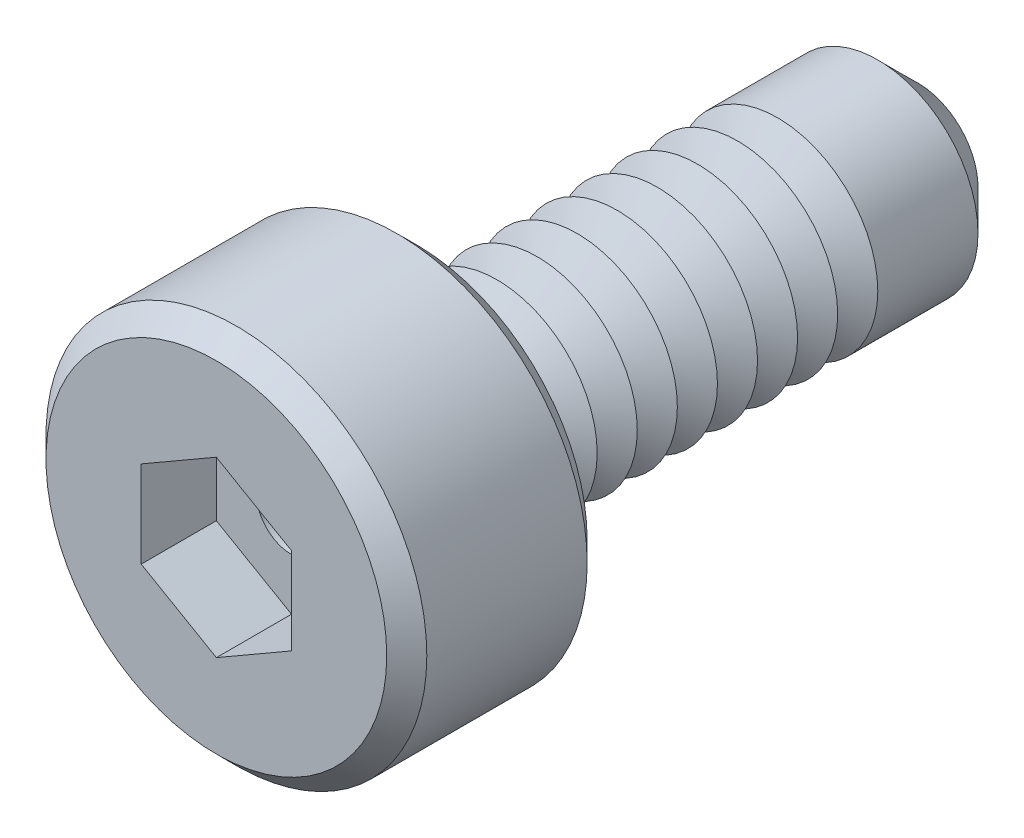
ISO-10303-21;
HEADER;
FILE_DESCRIPTION(('STEP AP214'),'2;1');
FILE_NAME('part.step','',(''),(''),'','','');
FILE_SCHEMA(('AUTOMOTIVE_DESIGN { 1 0 10303 214 1 1 1 1 }'));
ENDSEC;
DATA;
#1=APPLICATION_CONTEXT('core data for automotive mechanical design processes');
#2=APPLICATION_PROTOCOL_DEFINITION('international standard','automotive_design',2000,#1);
#3=PRODUCT_CONTEXT('',#1,'mechanical');
#4=PRODUCT('Part','Part','',(#3));
#5=PRODUCT_RELATED_PRODUCT_CATEGORY('part','',(#4));
#6=PRODUCT_DEFINITION_FORMATION('','',#4);
#7=PRODUCT_DEFINITION_CONTEXT('part definition',#1,'design');
#8=PRODUCT_DEFINITION('design','',#6,#7);
#9=PRODUCT_DEFINITION_SHAPE('','',#8);
#10=(LENGTH_UNIT() NAMED_UNIT(*) SI_UNIT(.MILLI.,.METRE.));
#11=(NAMED_UNIT(*) PLANE_ANGLE_UNIT() SI_UNIT($,.RADIAN.));
#12=(NAMED_UNIT(*) SI_UNIT($,.STERADIAN.) SOLID_ANGLE_UNIT());
#13=UNCERTAINTY_MEASURE_WITH_UNIT(LENGTH_MEASURE(1.E-05),#10,'distance_accuracy_value','');
#14=(GEOMETRIC_REPRESENTATION_CONTEXT(3) GLOBAL_UNCERTAINTY_ASSIGNED_CONTEXT((#13)) GLOBAL_UNIT_ASSIGNED_CONTEXT((#10,
#11,#12)) REPRESENTATION_CONTEXT('',''));
#15=CARTESIAN_POINT('',(0.,0.,0.));
#16=DIRECTION('',(0.,0.,1.));
#17=DIRECTION('',(1.,0.,0.));
#18=AXIS2_PLACEMENT_3D('',#15,#16,#17);
#19=CARTESIAN_POINT('',(0.,0.,2.));
#20=DIRECTION('',(0.,0.,-1.));
#21=DIRECTION('',(-1.,0.,0.));
#22=AXIS2_PLACEMENT_3D('',#19,#20,#21);
#23=CYLINDRICAL_SURFACE('',#22,1.9);
#24=CARTESIAN_POINT('',(0.,0.,0.200000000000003));
#25=DIRECTION('',(0.,0.,1.));
#26=DIRECTION('',(1.,0.,0.));
#27=AXIS2_PLACEMENT_3D('',#24,#25,#26);
#28=CIRCLE('',#27,1.9);
#29=CARTESIAN_POINT('',(1.9,0.,0.200000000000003));
#30=VERTEX_POINT('',#29);
#31=EDGE_CURVE('E252',#30,#30,#28,.T.);
#32=ORIENTED_EDGE('',*,*,#31,.T.);
#33=EDGE_LOOP('',(#32));
#34=FACE_BOUND('',#33,.T.);
#35=CARTESIAN_POINT('',(0.,0.,1.8));
#36=DIRECTION('',(0.,0.,1.));
#37=DIRECTION('',(1.,0.,0.));
#38=AXIS2_PLACEMENT_3D('',#35,#36,#37);
#39=CIRCLE('',#38,1.9);
#40=CARTESIAN_POINT('',(1.9,0.,1.8));
#41=VERTEX_POINT('',#40);
#42=EDGE_CURVE('E248',#41,#41,#39,.F.);
#43=ORIENTED_EDGE('',*,*,#42,.T.);
#44=EDGE_LOOP('',(#43));
#45=FACE_BOUND('',#44,.T.);
#46=ADVANCED_FACE('F39',(#34,#45),#23,.T.);
#47=CARTESIAN_POINT('',(0.,0.,2.));
#48=DIRECTION('',(0.,0.,1.));
#49=DIRECTION('',(1.,0.,0.));
#50=AXIS2_PLACEMENT_3D('',#47,#48,#49);
#51=PLANE('',#50);
#52=CARTESIAN_POINT('',(0.,0.,2.));
#53=DIRECTION('',(0.,0.,1.));
#54=DIRECTION('',(1.,0.,0.));
#55=AXIS2_PLACEMENT_3D('',#52,#53,#54);
#56=CIRCLE('',#55,1.7);
#57=CARTESIAN_POINT('',(1.7,0.,2.));
#58=VERTEX_POINT('',#57);
#59=EDGE_CURVE('E11',#58,#58,#56,.T.);
#60=ORIENTED_EDGE('',*,*,#59,.T.);
#61=EDGE_LOOP('',(#60));
#62=FACE_BOUND('',#61,.T.);
#63=DIRECTION('',(-0.866025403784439,0.5,0.));
#64=VECTOR('',#63,1.);
#65=CARTESIAN_POINT('',(0.749999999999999,0.433012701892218,2.));
#66=LINE('',#65,#64);
#67=CARTESIAN_POINT('',(0.749999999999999,0.433012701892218,2.));
#68=VERTEX_POINT('',#67);
#69=CARTESIAN_POINT('',(0.,0.866025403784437,2.));
#70=VERTEX_POINT('',#69);
#71=EDGE_CURVE('E55',#68,#70,#66,.T.);
#72=ORIENTED_EDGE('',*,*,#71,.F.);
#73=DIRECTION('',(0.,1.,0.));
#74=VECTOR('',#73,1.);
#75=CARTESIAN_POINT('',(0.75,-0.433012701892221,2.));
#76=LINE('',#75,#74);
#77=CARTESIAN_POINT('',(0.75,-0.433012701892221,2.));
#78=VERTEX_POINT('',#77);
#79=EDGE_CURVE('E151',#78,#68,#76,.T.);
#80=ORIENTED_EDGE('',*,*,#79,.F.);
#81=DIRECTION('',(0.866025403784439,0.5,0.));
#82=VECTOR('',#81,1.);
#83=CARTESIAN_POINT('',(0.,-0.86602540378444,2.));
#84=LINE('',#83,#82);
#85=CARTESIAN_POINT('',(0.,-0.86602540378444,2.));
#86=VERTEX_POINT('',#85);
#87=EDGE_CURVE('E148',#86,#78,#84,.T.);
#88=ORIENTED_EDGE('',*,*,#87,.F.);
#89=DIRECTION('',(0.866025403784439,-0.5,0.));
#90=VECTOR('',#89,1.);
#91=CARTESIAN_POINT('',(-0.75,-0.433012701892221,2.));
#92=LINE('',#91,#90);
#93=CARTESIAN_POINT('',(-0.75,-0.433012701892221,2.));
#94=VERTEX_POINT('',#93);
#95=EDGE_CURVE('E103',#94,#86,#92,.T.);
#96=ORIENTED_EDGE('',*,*,#95,.F.);
#97=DIRECTION('',(0.,-1.,0.));
#98=VECTOR('',#97,1.);
#99=CARTESIAN_POINT('',(-0.75,0.433012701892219,2.));
#100=LINE('',#99,#98);
#101=CARTESIAN_POINT('',(-0.75,0.433012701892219,2.));
#102=VERTEX_POINT('',#101);
#103=EDGE_CURVE('E142',#102,#94,#100,.T.);
#104=ORIENTED_EDGE('',*,*,#103,.F.);
#105=DIRECTION('',(-0.866025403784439,-0.499999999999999,0.));
#106=VECTOR('',#105,1.);
#107=CARTESIAN_POINT('',(0.,0.866025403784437,2.));
#108=LINE('',#107,#106);
#109=EDGE_CURVE('E137',#70,#102,#108,.T.);
#110=ORIENTED_EDGE('',*,*,#109,.F.);
#111=EDGE_LOOP('',(#72,#80,#88,#96,#104,#110));
#112=FACE_BOUND('',#111,.T.);
#113=ADVANCED_FACE('F270',(#62,#112),#51,.T.);
#114=CARTESIAN_POINT('',(0.,0.,0.));
#115=DIRECTION('',(0.,0.,1.));
#116=DIRECTION('',(1.,0.,0.));
#117=AXIS2_PLACEMENT_3D('',#114,#115,#116);
#118=PLANE('',#117);
#119=CARTESIAN_POINT('',(0.,0.,0.));
#120=DIRECTION('',(0.,0.,1.));
#121=DIRECTION('',(1.,0.,0.));
#122=AXIS2_PLACEMENT_3D('',#119,#120,#121);
#123=CIRCLE('',#122,1.7);
#124=CARTESIAN_POINT('',(1.7,0.,0.));
#125=VERTEX_POINT('',#124);
#126=EDGE_CURVE('E48',#125,#125,#123,.F.);
#127=ORIENTED_EDGE('',*,*,#126,.T.);
#128=EDGE_LOOP('',(#127));
#129=FACE_BOUND('',#128,.T.);
#130=CARTESIAN_POINT('',(0.,0.,0.));
#131=DIRECTION('',(0.,0.,1.));
#132=DIRECTION('',(1.,0.,0.));
#133=AXIS2_PLACEMENT_3D('',#130,#131,#132);
#134=CIRCLE('',#133,1.);
#135=CARTESIAN_POINT('',(1.,0.,0.));
#136=VERTEX_POINT('',#135);
#137=EDGE_CURVE('E236',#136,#136,#134,.T.);
#138=ORIENTED_EDGE('',*,*,#137,.T.);
#139=EDGE_LOOP('',(#138));
#140=FACE_BOUND('',#139,.T.);
#141=ADVANCED_FACE('F259',(#129,#140),#118,.F.);
#142=CARTESIAN_POINT('',(0.,0.,0.));
#143=DIRECTION('',(0.,0.,1.));
#144=DIRECTION('',(1.,0.,0.));
#145=AXIS2_PLACEMENT_3D('',#142,#143,#144);
#146=CONICAL_SURFACE('',#145,1.,1.0471975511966);
#147=CARTESIAN_POINT('',(0.,0.,-0.200000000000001));
#148=DIRECTION('',(0.,0.,1.));
#149=DIRECTION('',(1.,0.,0.));
#150=AXIS2_PLACEMENT_3D('',#147,#148,#149);
#151=CIRCLE('',#150,0.653589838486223);
#152=CARTESIAN_POINT('',(0.653589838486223,0.,-0.200000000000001));
#153=VERTEX_POINT('',#152);
#154=EDGE_CURVE('E232',#153,#153,#151,.T.);
#155=ORIENTED_EDGE('',*,*,#154,.T.);
#156=EDGE_LOOP('',(#155));
#157=FACE_BOUND('',#156,.T.);
#158=ORIENTED_EDGE('',*,*,#137,.F.);
#159=EDGE_LOOP('',(#158));
#160=FACE_BOUND('',#159,.T.);
#161=ADVANCED_FACE('F392',(#157,#160),#146,.T.);
#162=CARTESIAN_POINT('',(0.,0.,-0.200000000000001));
#163=DIRECTION('',(0.,0.,-1.));
#164=DIRECTION('',(-1.,0.,0.));
#165=AXIS2_PLACEMENT_3D('',#162,#163,#164);
#166=CONICAL_SURFACE('',#165,0.653589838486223,1.0471975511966);
#167=CARTESIAN_POINT('',(0.,0.,-0.4));
#168=DIRECTION('',(0.,0.,1.));
#169=DIRECTION('',(1.,0.,0.));
#170=AXIS2_PLACEMENT_3D('',#167,#168,#169);
#171=CIRCLE('',#170,1.);
#172=CARTESIAN_POINT('',(1.,0.,-0.4));
#173=VERTEX_POINT('',#172);
#174=EDGE_CURVE('E228',#173,#173,#171,.T.);
#175=ORIENTED_EDGE('',*,*,#174,.T.);
#176=EDGE_LOOP('',(#175));
#177=FACE_BOUND('',#176,.T.);
#178=ORIENTED_EDGE('',*,*,#154,.F.);
#179=EDGE_LOOP('',(#178));
#180=FACE_BOUND('',#179,.T.);
#181=ADVANCED_FACE('F388',(#177,#180),#166,.T.);
#182=CARTESIAN_POINT('',(0.,0.,-0.4));
#183=DIRECTION('',(0.,0.,1.));
#184=DIRECTION('',(1.,0.,0.));
#185=AXIS2_PLACEMENT_3D('',#182,#183,#184);
#186=CONICAL_SURFACE('',#185,1.,1.0471975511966);
#187=CARTESIAN_POINT('',(0.,0.,-0.600000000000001));
#188=DIRECTION('',(0.,0.,1.));
#189=DIRECTION('',(1.,0.,0.));
#190=AXIS2_PLACEMENT_3D('',#187,#188,#189);
#191=CIRCLE('',#190,0.653589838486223);
#192=CARTESIAN_POINT('',(0.653589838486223,0.,-0.600000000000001));
#193=VERTEX_POINT('',#192);
#194=EDGE_CURVE('E224',#193,#193,#191,.T.);
#195=ORIENTED_EDGE('',*,*,#194,.T.);
#196=EDGE_LOOP('',(#195));
#197=FACE_BOUND('',#196,.T.);
#198=ORIENTED_EDGE('',*,*,#174,.F.);
#199=EDGE_LOOP('',(#198));
#200=FACE_BOUND('',#199,.T.);
#201=ADVANCED_FACE('F384',(#197,#200),#186,.T.);
#202=CARTESIAN_POINT('',(0.,0.,-0.600000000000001));
#203=DIRECTION('',(0.,0.,-1.));
#204=DIRECTION('',(-1.,0.,0.));
#205=AXIS2_PLACEMENT_3D('',#202,#203,#204);
#206=CONICAL_SURFACE('',#205,0.653589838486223,1.0471975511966);
#207=CARTESIAN_POINT('',(0.,0.,-0.8));
#208=DIRECTION('',(0.,0.,1.));
#209=DIRECTION('',(1.,0.,0.));
#210=AXIS2_PLACEMENT_3D('',#207,#208,#209);
#211=CIRCLE('',#210,1.);
#212=CARTESIAN_POINT('',(1.,0.,-0.8));
#213=VERTEX_POINT('',#212);
#214=EDGE_CURVE('E220',#213,#213,#211,.T.);
#215=ORIENTED_EDGE('',*,*,#214,.T.);
#216=EDGE_LOOP('',(#215));
#217=FACE_BOUND('',#216,.T.);
#218=ORIENTED_EDGE('',*,*,#194,.F.);
#219=EDGE_LOOP('',(#218));
#220=FACE_BOUND('',#219,.T.);
#221=ADVANCED_FACE('F380',(#217,#220),#206,.T.);
#222=CARTESIAN_POINT('',(0.,0.,-0.8));
#223=DIRECTION('',(0.,0.,1.));
#224=DIRECTION('',(1.,0.,0.));
#225=AXIS2_PLACEMENT_3D('',#222,#223,#224);
#226=CONICAL_SURFACE('',#225,1.,1.0471975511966);
#227=CARTESIAN_POINT('',(0.,0.,-1.));
#228=DIRECTION('',(0.,0.,1.));
#229=DIRECTION('',(1.,0.,0.));
#230=AXIS2_PLACEMENT_3D('',#227,#228,#229);
#231=CIRCLE('',#230,0.653589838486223);
#232=CARTESIAN_POINT('',(0.653589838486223,0.,-1.));
#233=VERTEX_POINT('',#232);
#234=EDGE_CURVE('E216',#233,#233,#231,.T.);
#235=ORIENTED_EDGE('',*,*,#234,.T.);
#236=EDGE_LOOP('',(#235));
#237=FACE_BOUND('',#236,.T.);
#238=ORIENTED_EDGE('',*,*,#214,.F.);
#239=EDGE_LOOP('',(#238));
#240=FACE_BOUND('',#239,.T.);
#241=ADVANCED_FACE('F376',(#237,#240),#226,.T.);
#242=CARTESIAN_POINT('',(0.,0.,-1.));
#243=DIRECTION('',(0.,0.,-1.));
#244=DIRECTION('',(-1.,0.,0.));
#245=AXIS2_PLACEMENT_3D('',#242,#243,#244);
#246=CONICAL_SURFACE('',#245,0.653589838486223,1.0471975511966);
#247=CARTESIAN_POINT('',(0.,0.,-1.2));
#248=DIRECTION('',(0.,0.,1.));
#249=DIRECTION('',(1.,0.,0.));
#250=AXIS2_PLACEMENT_3D('',#247,#248,#249);
#251=CIRCLE('',#250,1.);
#252=CARTESIAN_POINT('',(1.,0.,-1.2));
#253=VERTEX_POINT('',#252);
#254=EDGE_CURVE('E212',#253,#253,#251,.T.);
#255=ORIENTED_EDGE('',*,*,#254,.T.);
#256=EDGE_LOOP('',(#255));
#257=FACE_BOUND('',#256,.T.);
#258=ORIENTED_EDGE('',*,*,#234,.F.);
#259=EDGE_LOOP('',(#258));
#260=FACE_BOUND('',#259,.T.);
#261=ADVANCED_FACE('F372',(#257,#260),#246,.T.);
#262=CARTESIAN_POINT('',(0.,0.,-1.2));
#263=DIRECTION('',(0.,0.,1.));
#264=DIRECTION('',(1.,0.,0.));
#265=AXIS2_PLACEMENT_3D('',#262,#263,#264);
#266=CONICAL_SURFACE('',#265,1.,1.0471975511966);
#267=CARTESIAN_POINT('',(0.,0.,-1.4));
#268=DIRECTION('',(0.,0.,1.));
#269=DIRECTION('',(1.,0.,0.));
#270=AXIS2_PLACEMENT_3D('',#267,#268,#269);
#271=CIRCLE('',#270,0.653589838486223);
#272=CARTESIAN_POINT('',(0.653589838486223,0.,-1.4));
#273=VERTEX_POINT('',#272);
#274=EDGE_CURVE('E208',#273,#273,#271,.T.);
#275=ORIENTED_EDGE('',*,*,#274,.T.);
#276=EDGE_LOOP('',(#275));
#277=FACE_BOUND('',#276,.T.);
#278=ORIENTED_EDGE('',*,*,#254,.F.);
#279=EDGE_LOOP('',(#278));
#280=FACE_BOUND('',#279,.T.);
#281=ADVANCED_FACE('F368',(#277,#280),#266,.T.);
#282=CARTESIAN_POINT('',(0.,0.,-1.4));
#283=DIRECTION('',(0.,0.,-1.));
#284=DIRECTION('',(-1.,0.,0.));
#285=AXIS2_PLACEMENT_3D('',#282,#283,#284);
#286=CONICAL_SURFACE('',#285,0.653589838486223,1.0471975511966);
#287=CARTESIAN_POINT('',(0.,0.,-1.6));
#288=DIRECTION('',(0.,0.,1.));
#289=DIRECTION('',(1.,0.,0.));
#290=AXIS2_PLACEMENT_3D('',#287,#288,#289);
#291=CIRCLE('',#290,1.);
#292=CARTESIAN_POINT('',(1.,0.,-1.6));
#293=VERTEX_POINT('',#292);
#294=EDGE_CURVE('E204',#293,#293,#291,.T.);
#295=ORIENTED_EDGE('',*,*,#294,.T.);
#296=EDGE_LOOP('',(#295));
#297=FACE_BOUND('',#296,.T.);
#298=ORIENTED_EDGE('',*,*,#274,.F.);
#299=EDGE_LOOP('',(#298));
#300=FACE_BOUND('',#299,.T.);
#301=ADVANCED_FACE('F364',(#297,#300),#286,.T.);
#302=CARTESIAN_POINT('',(0.,0.,-1.6));
#303=DIRECTION('',(0.,0.,1.));
#304=DIRECTION('',(1.,0.,0.));
#305=AXIS2_PLACEMENT_3D('',#302,#303,#304);
#306=CONICAL_SURFACE('',#305,1.,1.0471975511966);
#307=CARTESIAN_POINT('',(0.,0.,-1.8));
#308=DIRECTION('',(0.,0.,1.));
#309=DIRECTION('',(1.,0.,0.));
#310=AXIS2_PLACEMENT_3D('',#307,#308,#309);
#311=CIRCLE('',#310,0.653589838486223);
#312=CARTESIAN_POINT('',(0.653589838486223,0.,-1.8));
#313=VERTEX_POINT('',#312);
#314=EDGE_CURVE('E201',#313,#313,#311,.T.);
#315=ORIENTED_EDGE('',*,*,#314,.T.);
#316=EDGE_LOOP('',(#315));
#317=FACE_BOUND('',#316,.T.);
#318=ORIENTED_EDGE('',*,*,#294,.F.);
#319=EDGE_LOOP('',(#318));
#320=FACE_BOUND('',#319,.T.);
#321=ADVANCED_FACE('F360',(#317,#320),#306,.T.);
#322=CARTESIAN_POINT('',(0.,0.,-1.8));
#323=DIRECTION('',(0.,0.,-1.));
#324=DIRECTION('',(-1.,0.,0.));
#325=AXIS2_PLACEMENT_3D('',#322,#323,#324);
#326=CONICAL_SURFACE('',#325,0.653589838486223,1.0471975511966);
#327=CARTESIAN_POINT('',(0.,0.,-2.));
#328=DIRECTION('',(0.,0.,1.));
#329=DIRECTION('',(1.,0.,0.));
#330=AXIS2_PLACEMENT_3D('',#327,#328,#329);
#331=CIRCLE('',#330,1.);
#332=CARTESIAN_POINT('',(1.,0.,-2.));
#333=VERTEX_POINT('',#332);
#334=EDGE_CURVE('E197',#333,#333,#331,.T.);
#335=ORIENTED_EDGE('',*,*,#334,.T.);
#336=EDGE_LOOP('',(#335));
#337=FACE_BOUND('',#336,.T.);
#338=ORIENTED_EDGE('',*,*,#314,.F.);
#339=EDGE_LOOP('',(#338));
#340=FACE_BOUND('',#339,.T.);
#341=ADVANCED_FACE('F356',(#337,#340),#326,.T.);
#342=CARTESIAN_POINT('',(0.,0.,-2.));
#343=DIRECTION('',(0.,0.,1.));
#344=DIRECTION('',(1.,0.,0.));
#345=AXIS2_PLACEMENT_3D('',#342,#343,#344);
#346=CONICAL_SURFACE('',#345,1.,1.0471975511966);
#347=CARTESIAN_POINT('',(0.,0.,-2.2));
#348=DIRECTION('',(0.,0.,1.));
#349=DIRECTION('',(1.,0.,0.));
#350=AXIS2_PLACEMENT_3D('',#347,#348,#349);
#351=CIRCLE('',#350,0.653589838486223);
#352=CARTESIAN_POINT('',(0.653589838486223,0.,-2.2));
#353=VERTEX_POINT('',#352);
#354=EDGE_CURVE('E193',#353,#353,#351,.T.);
#355=ORIENTED_EDGE('',*,*,#354,.T.);
#356=EDGE_LOOP('',(#355));
#357=FACE_BOUND('',#356,.T.);
#358=ORIENTED_EDGE('',*,*,#334,.F.);
#359=EDGE_LOOP('',(#358));
#360=FACE_BOUND('',#359,.T.);
#361=ADVANCED_FACE('F352',(#357,#360),#346,.T.);
#362=CARTESIAN_POINT('',(0.,0.,-2.2));
#363=DIRECTION('',(0.,0.,-1.));
#364=DIRECTION('',(-1.,0.,0.));
#365=AXIS2_PLACEMENT_3D('',#362,#363,#364);
#366=CONICAL_SURFACE('',#365,0.653589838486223,1.0471975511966);
#367=CARTESIAN_POINT('',(0.,0.,-2.4));
#368=DIRECTION('',(0.,0.,1.));
#369=DIRECTION('',(1.,0.,0.));
#370=AXIS2_PLACEMENT_3D('',#367,#368,#369);
#371=CIRCLE('',#370,1.);
#372=CARTESIAN_POINT('',(1.,0.,-2.4));
#373=VERTEX_POINT('',#372);
#374=EDGE_CURVE('E189',#373,#373,#371,.T.);
#375=ORIENTED_EDGE('',*,*,#374,.T.);
#376=EDGE_LOOP('',(#375));
#377=FACE_BOUND('',#376,.T.);
#378=ORIENTED_EDGE('',*,*,#354,.F.);
#379=EDGE_LOOP('',(#378));
#380=FACE_BOUND('',#379,.T.);
#381=ADVANCED_FACE('F348',(#377,#380),#366,.T.);
#382=CARTESIAN_POINT('',(0.,0.,-2.4));
#383=DIRECTION('',(0.,0.,1.));
#384=DIRECTION('',(1.,0.,0.));
#385=AXIS2_PLACEMENT_3D('',#382,#383,#384);
#386=CONICAL_SURFACE('',#385,1.,1.0471975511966);
#387=CARTESIAN_POINT('',(0.,0.,-2.6));
#388=DIRECTION('',(0.,0.,1.));
#389=DIRECTION('',(1.,0.,0.));
#390=AXIS2_PLACEMENT_3D('',#387,#388,#389);
#391=CIRCLE('',#390,0.653589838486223);
#392=CARTESIAN_POINT('',(0.653589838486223,0.,-2.6));
#393=VERTEX_POINT('',#392);
#394=EDGE_CURVE('E185',#393,#393,#391,.T.);
#395=ORIENTED_EDGE('',*,*,#394,.T.);
#396=EDGE_LOOP('',(#395));
#397=FACE_BOUND('',#396,.T.);
#398=ORIENTED_EDGE('',*,*,#374,.F.);
#399=EDGE_LOOP('',(#398));
#400=FACE_BOUND('',#399,.T.);
#401=ADVANCED_FACE('F344',(#397,#400),#386,.T.);
#402=CARTESIAN_POINT('',(0.,0.,-2.6));
#403=DIRECTION('',(0.,0.,-1.));
#404=DIRECTION('',(-1.,0.,0.));
#405=AXIS2_PLACEMENT_3D('',#402,#403,#404);
#406=CONICAL_SURFACE('',#405,0.653589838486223,1.0471975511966);
#407=CARTESIAN_POINT('',(0.,0.,-2.8));
#408=DIRECTION('',(0.,0.,1.));
#409=DIRECTION('',(1.,0.,0.));
#410=AXIS2_PLACEMENT_3D('',#407,#408,#409);
#411=CIRCLE('',#410,1.);
#412=CARTESIAN_POINT('',(1.,0.,-2.8));
#413=VERTEX_POINT('',#412);
#414=EDGE_CURVE('E181',#413,#413,#411,.T.);
#415=ORIENTED_EDGE('',*,*,#414,.T.);
#416=EDGE_LOOP('',(#415));
#417=FACE_BOUND('',#416,.T.);
#418=ORIENTED_EDGE('',*,*,#394,.F.);
#419=EDGE_LOOP('',(#418));
#420=FACE_BOUND('',#419,.T.);
#421=ADVANCED_FACE('F340',(#417,#420),#406,.T.);
#422=CARTESIAN_POINT('',(0.,0.,-2.8));
#423=DIRECTION('',(0.,0.,1.));
#424=DIRECTION('',(1.,0.,0.));
#425=AXIS2_PLACEMENT_3D('',#422,#423,#424);
#426=CONICAL_SURFACE('',#425,1.,1.0471975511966);
#427=CARTESIAN_POINT('',(0.,0.,-3.));
#428=DIRECTION('',(0.,0.,1.));
#429=DIRECTION('',(1.,0.,0.));
#430=AXIS2_PLACEMENT_3D('',#427,#428,#429);
#431=CIRCLE('',#430,0.653589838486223);
#432=CARTESIAN_POINT('',(0.653589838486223,0.,-3.));
#433=VERTEX_POINT('',#432);
#434=EDGE_CURVE('E177',#433,#433,#431,.T.);
#435=ORIENTED_EDGE('',*,*,#434,.T.);
#436=EDGE_LOOP('',(#435));
#437=FACE_BOUND('',#436,.T.);
#438=ORIENTED_EDGE('',*,*,#414,.F.);
#439=EDGE_LOOP('',(#438));
#440=FACE_BOUND('',#439,.T.);
#441=ADVANCED_FACE('F336',(#437,#440),#426,.T.);
#442=CARTESIAN_POINT('',(0.,0.,-3.));
#443=DIRECTION('',(0.,0.,-1.));
#444=DIRECTION('',(-1.,0.,0.));
#445=AXIS2_PLACEMENT_3D('',#442,#443,#444);
#446=CONICAL_SURFACE('',#445,0.653589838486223,1.0471975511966);
#447=CARTESIAN_POINT('',(0.,0.,-3.2));
#448=DIRECTION('',(0.,0.,1.));
#449=DIRECTION('',(1.,0.,0.));
#450=AXIS2_PLACEMENT_3D('',#447,#448,#449);
#451=CIRCLE('',#450,1.);
#452=CARTESIAN_POINT('',(1.,0.,-3.2));
#453=VERTEX_POINT('',#452);
#454=EDGE_CURVE('E174',#453,#453,#451,.T.);
#455=ORIENTED_EDGE('',*,*,#454,.T.);
#456=EDGE_LOOP('',(#455));
#457=FACE_BOUND('',#456,.T.);
#458=ORIENTED_EDGE('',*,*,#434,.F.);
#459=EDGE_LOOP('',(#458));
#460=FACE_BOUND('',#459,.T.);
#461=ADVANCED_FACE('F332',(#457,#460),#446,.T.);
#462=CARTESIAN_POINT('',(0.,0.,-3.2));
#463=DIRECTION('',(0.,0.,1.));
#464=DIRECTION('',(1.,0.,0.));
#465=AXIS2_PLACEMENT_3D('',#462,#463,#464);
#466=CONICAL_SURFACE('',#465,1.,1.0471975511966);
#467=CARTESIAN_POINT('',(0.,0.,-3.4));
#468=DIRECTION('',(0.,0.,1.));
#469=DIRECTION('',(1.,0.,0.));
#470=AXIS2_PLACEMENT_3D('',#467,#468,#469);
#471=CIRCLE('',#470,0.653589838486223);
#472=CARTESIAN_POINT('',(0.653589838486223,0.,-3.4));
#473=VERTEX_POINT('',#472);
#474=EDGE_CURVE('E170',#473,#473,#471,.T.);
#475=ORIENTED_EDGE('',*,*,#474,.T.);
#476=EDGE_LOOP('',(#475));
#477=FACE_BOUND('',#476,.T.);
#478=ORIENTED_EDGE('',*,*,#454,.F.);
#479=EDGE_LOOP('',(#478));
#480=FACE_BOUND('',#479,.T.);
#481=ADVANCED_FACE('F328',(#477,#480),#466,.T.);
#482=CARTESIAN_POINT('',(0.,0.,-3.4));
#483=DIRECTION('',(0.,0.,-1.));
#484=DIRECTION('',(-1.,0.,0.));
#485=AXIS2_PLACEMENT_3D('',#482,#483,#484);
#486=CONICAL_SURFACE('',#485,0.653589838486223,1.0471975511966);
#487=CARTESIAN_POINT('',(0.,0.,-3.6));
#488=DIRECTION('',(0.,0.,1.));
#489=DIRECTION('',(1.,0.,0.));
#490=AXIS2_PLACEMENT_3D('',#487,#488,#489);
#491=CIRCLE('',#490,1.);
#492=CARTESIAN_POINT('',(1.,0.,-3.6));
#493=VERTEX_POINT('',#492);
#494=EDGE_CURVE('E157',#493,#493,#491,.T.);
#495=ORIENTED_EDGE('',*,*,#494,.T.);
#496=EDGE_LOOP('',(#495));
#497=FACE_BOUND('',#496,.T.);
#498=ORIENTED_EDGE('',*,*,#474,.F.);
#499=EDGE_LOOP('',(#498));
#500=FACE_BOUND('',#499,.T.);
#501=ADVANCED_FACE('F324',(#497,#500),#486,.T.);
#502=CARTESIAN_POINT('',(0.,0.,-5.));
#503=DIRECTION('',(0.,0.,-1.));
#504=DIRECTION('',(-1.,0.,0.));
#505=AXIS2_PLACEMENT_3D('',#502,#503,#504);
#506=PLANE('',#505);
#507=CARTESIAN_POINT('',(0.,0.,-5.));
#508=DIRECTION('',(0.,0.,-1.));
#509=DIRECTION('',(-1.,0.,0.));
#510=AXIS2_PLACEMENT_3D('',#507,#508,#509);
#511=CIRCLE('',#510,0.35);
#512=CARTESIAN_POINT('',(-0.35,0.,-5.));
#513=VERTEX_POINT('',#512);
#514=EDGE_CURVE('E138',#513,#513,#511,.F.);
#515=ORIENTED_EDGE('',*,*,#514,.T.);
#516=EDGE_LOOP('',(#515));
#517=FACE_BOUND('',#516,.T.);
#518=CARTESIAN_POINT('',(0.,0.,-5.));
#519=DIRECTION('',(0.,0.,-1.));
#520=DIRECTION('',(-1.,0.,0.));
#521=AXIS2_PLACEMENT_3D('',#518,#519,#520);
#522=CIRCLE('',#521,0.6);
#523=CARTESIAN_POINT('',(-0.6,0.,-5.));
#524=VERTEX_POINT('',#523);
#525=EDGE_CURVE('E240',#524,#524,#522,.T.);
#526=ORIENTED_EDGE('',*,*,#525,.T.);
#527=EDGE_LOOP('',(#526));
#528=FACE_BOUND('',#527,.T.);
#529=ADVANCED_FACE('F327',(#517,#528),#506,.T.);
#530=CARTESIAN_POINT('',(0.,0.,-5.));
#531=DIRECTION('',(0.,0.,1.));
#532=DIRECTION('',(1.,0.,0.));
#533=AXIS2_PLACEMENT_3D('',#530,#531,#532);
#534=CONICAL_SURFACE('',#533,0.6,0.785398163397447);
#535=CARTESIAN_POINT('',(0.,0.,-4.6));
#536=DIRECTION('',(0.,0.,-1.));
#537=DIRECTION('',(-1.,0.,0.));
#538=AXIS2_PLACEMENT_3D('',#535,#536,#537);
#539=CIRCLE('',#538,1.);
#540=CARTESIAN_POINT('',(-1.,0.,-4.6));
#541=VERTEX_POINT('',#540);
#542=EDGE_CURVE('E244',#541,#541,#539,.F.);
#543=ORIENTED_EDGE('',*,*,#542,.F.);
#544=EDGE_LOOP('',(#543));
#545=FACE_BOUND('',#544,.T.);
#546=ORIENTED_EDGE('',*,*,#525,.F.);
#547=EDGE_LOOP('',(#546));
#548=FACE_BOUND('',#547,.T.);
#549=ADVANCED_FACE('F399',(#545,#548),#534,.T.);
#550=CARTESIAN_POINT('',(0.,0.,-5.));
#551=DIRECTION('',(0.,0.,1.));
#552=DIRECTION('',(1.,0.,0.));
#553=AXIS2_PLACEMENT_3D('',#550,#551,#552);
#554=CYLINDRICAL_SURFACE('',#553,1.);
#555=ORIENTED_EDGE('',*,*,#542,.T.);
#556=EDGE_LOOP('',(#555));
#557=FACE_BOUND('',#556,.T.);
#558=ORIENTED_EDGE('',*,*,#494,.F.);
#559=EDGE_LOOP('',(#558));
#560=FACE_BOUND('',#559,.T.);
#561=ADVANCED_FACE('F323',(#557,#560),#554,.T.);
#562=CARTESIAN_POINT('',(0.749999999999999,0.433012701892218,1.25));
#563=DIRECTION('',(0.5,0.866025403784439,0.));
#564=DIRECTION('',(-0.866025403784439,0.5,0.));
#565=AXIS2_PLACEMENT_3D('',#562,#563,#564);
#566=PLANE('',#565);
#567=ORIENTED_EDGE('',*,*,#71,.T.);
#568=DIRECTION('',(0.,0.,1.));
#569=VECTOR('',#568,1.);
#570=CARTESIAN_POINT('',(0.,0.866025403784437,1.25));
#571=LINE('',#570,#569);
#572=CARTESIAN_POINT('',(0.,0.866025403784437,1.25));
#573=VERTEX_POINT('',#572);
#574=EDGE_CURVE('E85',#573,#70,#571,.T.);
#575=ORIENTED_EDGE('',*,*,#574,.F.);
#576=DIRECTION('',(-0.866025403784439,0.5,0.));
#577=VECTOR('',#576,1.);
#578=CARTESIAN_POINT('',(0.749999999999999,0.433012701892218,1.25));
#579=LINE('',#578,#577);
#580=CARTESIAN_POINT('',(0.749999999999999,0.433012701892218,1.25));
#581=VERTEX_POINT('',#580);
#582=EDGE_CURVE('E154',#581,#573,#579,.T.);
#583=ORIENTED_EDGE('',*,*,#582,.F.);
#584=DIRECTION('',(0.,0.,1.));
#585=VECTOR('',#584,1.);
#586=CARTESIAN_POINT('',(0.749999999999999,0.433012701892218,1.25));
#587=LINE('',#586,#585);
#588=EDGE_CURVE('E63',#581,#68,#587,.T.);
#589=ORIENTED_EDGE('',*,*,#588,.T.);
#590=EDGE_LOOP('',(#567,#575,#583,#589));
#591=FACE_BOUND('',#590,.T.);
#592=ADVANCED_FACE('F313',(#591),#566,.F.);
#593=CARTESIAN_POINT('',(0.75,-0.433012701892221,1.25));
#594=DIRECTION('',(1.,0.,0.));
#595=DIRECTION('',(0.,1.,0.));
#596=AXIS2_PLACEMENT_3D('',#593,#594,#595);
#597=PLANE('',#596);
#598=ORIENTED_EDGE('',*,*,#79,.T.);
#599=ORIENTED_EDGE('',*,*,#588,.F.);
#600=DIRECTION('',(0.,1.,0.));
#601=VECTOR('',#600,1.);
#602=CARTESIAN_POINT('',(0.75,-0.433012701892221,1.25));
#603=LINE('',#602,#601);
#604=CARTESIAN_POINT('',(0.75,-0.433012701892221,1.25));
#605=VERTEX_POINT('',#604);
#606=EDGE_CURVE('E117',#605,#581,#603,.T.);
#607=ORIENTED_EDGE('',*,*,#606,.F.);
#608=DIRECTION('',(0.,0.,1.));
#609=VECTOR('',#608,1.);
#610=CARTESIAN_POINT('',(0.75,-0.433012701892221,1.25));
#611=LINE('',#610,#609);
#612=EDGE_CURVE('E108',#605,#78,#611,.T.);
#613=ORIENTED_EDGE('',*,*,#612,.T.);
#614=EDGE_LOOP('',(#598,#599,#607,#613));
#615=FACE_BOUND('',#614,.T.);
#616=ADVANCED_FACE('F310',(#615),#597,.F.);
#617=CARTESIAN_POINT('',(0.,-0.86602540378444,1.25));
#618=DIRECTION('',(0.5,-0.866025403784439,0.));
#619=DIRECTION('',(0.866025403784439,0.5,0.));
#620=AXIS2_PLACEMENT_3D('',#617,#618,#619);
#621=PLANE('',#620);
#622=ORIENTED_EDGE('',*,*,#87,.T.);
#623=ORIENTED_EDGE('',*,*,#612,.F.);
#624=DIRECTION('',(0.866025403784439,0.5,0.));
#625=VECTOR('',#624,1.);
#626=CARTESIAN_POINT('',(0.,-0.86602540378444,1.25));
#627=LINE('',#626,#625);
#628=CARTESIAN_POINT('',(0.,-0.86602540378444,1.25));
#629=VERTEX_POINT('',#628);
#630=EDGE_CURVE('E112',#629,#605,#627,.T.);
#631=ORIENTED_EDGE('',*,*,#630,.F.);
#632=DIRECTION('',(0.,0.,1.));
#633=VECTOR('',#632,1.);
#634=CARTESIAN_POINT('',(0.,-0.86602540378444,1.25));
#635=LINE('',#634,#633);
#636=EDGE_CURVE('E96',#629,#86,#635,.T.);
#637=ORIENTED_EDGE('',*,*,#636,.T.);
#638=EDGE_LOOP('',(#622,#623,#631,#637));
#639=FACE_BOUND('',#638,.T.);
#640=ADVANCED_FACE('F113',(#639),#621,.F.);
#641=CARTESIAN_POINT('',(-0.75,-0.433012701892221,1.25));
#642=DIRECTION('',(-0.5,-0.866025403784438,0.));
#643=DIRECTION('',(0.866025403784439,-0.5,0.));
#644=AXIS2_PLACEMENT_3D('',#641,#642,#643);
#645=PLANE('',#644);
#646=ORIENTED_EDGE('',*,*,#95,.T.);
#647=ORIENTED_EDGE('',*,*,#636,.F.);
#648=DIRECTION('',(0.866025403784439,-0.5,0.));
#649=VECTOR('',#648,1.);
#650=CARTESIAN_POINT('',(-0.75,-0.433012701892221,1.25));
#651=LINE('',#650,#649);
#652=CARTESIAN_POINT('',(-0.75,-0.433012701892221,1.25));
#653=VERTEX_POINT('',#652);
#654=EDGE_CURVE('E100',#653,#629,#651,.T.);
#655=ORIENTED_EDGE('',*,*,#654,.F.);
#656=DIRECTION('',(0.,0.,1.));
#657=VECTOR('',#656,1.);
#658=CARTESIAN_POINT('',(-0.75,-0.433012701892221,1.25));
#659=LINE('',#658,#657);
#660=EDGE_CURVE('E109',#653,#94,#659,.T.);
#661=ORIENTED_EDGE('',*,*,#660,.T.);
#662=EDGE_LOOP('',(#646,#647,#655,#661));
#663=FACE_BOUND('',#662,.T.);
#664=ADVANCED_FACE('F98',(#663),#645,.F.);
#665=CARTESIAN_POINT('',(-0.75,0.433012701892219,1.25));
#666=DIRECTION('',(-1.,0.,0.));
#667=DIRECTION('',(0.,0.,1.));
#668=AXIS2_PLACEMENT_3D('',#665,#666,#667);
#669=PLANE('',#668);
#670=ORIENTED_EDGE('',*,*,#103,.T.);
#671=ORIENTED_EDGE('',*,*,#660,.F.);
#672=DIRECTION('',(0.,-1.,0.));
#673=VECTOR('',#672,1.);
#674=CARTESIAN_POINT('',(-0.75,0.433012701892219,1.25));
#675=LINE('',#674,#673);
#676=CARTESIAN_POINT('',(-0.75,0.433012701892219,1.25));
#677=VERTEX_POINT('',#676);
#678=EDGE_CURVE('E123',#677,#653,#675,.T.);
#679=ORIENTED_EDGE('',*,*,#678,.F.);
#680=DIRECTION('',(0.,0.,1.));
#681=VECTOR('',#680,1.);
#682=CARTESIAN_POINT('',(-0.75,0.433012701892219,1.25));
#683=LINE('',#682,#681);
#684=EDGE_CURVE('E162',#677,#102,#683,.T.);
#685=ORIENTED_EDGE('',*,*,#684,.T.);
#686=EDGE_LOOP('',(#670,#671,#679,#685));
#687=FACE_BOUND('',#686,.T.);
#688=ADVANCED_FACE('F307',(#687),#669,.F.);
#689=CARTESIAN_POINT('',(0.,0.866025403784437,1.25));
#690=DIRECTION('',(-0.499999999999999,0.866025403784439,0.));
#691=DIRECTION('',(-0.866025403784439,-0.499999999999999,0.));
#692=AXIS2_PLACEMENT_3D('',#689,#690,#691);
#693=PLANE('',#692);
#694=ORIENTED_EDGE('',*,*,#109,.T.);
#695=ORIENTED_EDGE('',*,*,#684,.F.);
#696=DIRECTION('',(-0.866025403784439,-0.499999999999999,0.));
#697=VECTOR('',#696,1.);
#698=CARTESIAN_POINT('',(0.,0.866025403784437,1.25));
#699=LINE('',#698,#697);
#700=EDGE_CURVE('E129',#573,#677,#699,.T.);
#701=ORIENTED_EDGE('',*,*,#700,.F.);
#702=ORIENTED_EDGE('',*,*,#574,.T.);
#703=EDGE_LOOP('',(#694,#695,#701,#702));
#704=FACE_BOUND('',#703,.T.);
#705=ADVANCED_FACE('F285',(#704),#693,.F.);
#706=CARTESIAN_POINT('',(0.,0.,1.25));
#707=DIRECTION('',(0.,0.,1.));
#708=DIRECTION('',(1.,0.,0.));
#709=AXIS2_PLACEMENT_3D('',#706,#707,#708);
#710=PLANE('',#709);
#711=CARTESIAN_POINT('',(0.,0.,1.25));
#712=DIRECTION('',(0.,0.,1.));
#713=DIRECTION('',(1.,0.,0.));
#714=AXIS2_PLACEMENT_3D('',#711,#712,#713);
#715=CIRCLE('',#714,0.35);
#716=CARTESIAN_POINT('',(0.35,0.,1.25));
#717=VERTEX_POINT('',#716);
#718=EDGE_CURVE('E293',#717,#717,#715,.T.);
#719=ORIENTED_EDGE('',*,*,#718,.F.);
#720=EDGE_LOOP('',(#719));
#721=FACE_BOUND('',#720,.T.);
#722=ORIENTED_EDGE('',*,*,#582,.T.);
#723=ORIENTED_EDGE('',*,*,#700,.T.);
#724=ORIENTED_EDGE('',*,*,#678,.T.);
#725=ORIENTED_EDGE('',*,*,#654,.T.);
#726=ORIENTED_EDGE('',*,*,#630,.T.);
#727=ORIENTED_EDGE('',*,*,#606,.T.);
#728=EDGE_LOOP('',(#722,#723,#724,#725,#726,#727));
#729=FACE_BOUND('',#728,.T.);
#730=ADVANCED_FACE('F120',(#721,#729),#710,.T.);
#731=CARTESIAN_POINT('',(0.,0.,-5.98994949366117));
#732=DIRECTION('',(0.,0.,1.));
#733=DIRECTION('',(1.,0.,0.));
#734=AXIS2_PLACEMENT_3D('',#731,#732,#733);
#735=CYLINDRICAL_SURFACE('',#734,0.35);
#736=ORIENTED_EDGE('',*,*,#718,.T.);
#737=EDGE_LOOP('',(#736));
#738=FACE_BOUND('',#737,.T.);
#739=ORIENTED_EDGE('',*,*,#514,.F.);
#740=EDGE_LOOP('',(#739));
#741=FACE_BOUND('',#740,.T.);
#742=ADVANCED_FACE('F265',(#738,#741),#735,.F.);
#743=CARTESIAN_POINT('',(0.,0.,0.200000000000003));
#744=DIRECTION('',(0.,0.,1.));
#745=DIRECTION('',(1.,0.,0.));
#746=AXIS2_PLACEMENT_3D('',#743,#744,#745);
#747=CONICAL_SURFACE('',#746,1.9,0.78539816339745);
#748=ORIENTED_EDGE('',*,*,#126,.F.);
#749=EDGE_LOOP('',(#748));
#750=FACE_BOUND('',#749,.T.);
#751=ORIENTED_EDGE('',*,*,#31,.F.);
#752=EDGE_LOOP('',(#751));
#753=FACE_BOUND('',#752,.T.);
#754=ADVANCED_FACE('F262',(#750,#753),#747,.T.);
#755=CARTESIAN_POINT('',(0.,0.,2.));
#756=DIRECTION('',(0.,0.,-1.));
#757=DIRECTION('',(-1.,0.,0.));
#758=AXIS2_PLACEMENT_3D('',#755,#756,#757);
#759=CONICAL_SURFACE('',#758,1.7,0.785398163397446);
#760=ORIENTED_EDGE('',*,*,#42,.F.);
#761=EDGE_LOOP('',(#760));
#762=FACE_BOUND('',#761,.T.);
#763=ORIENTED_EDGE('',*,*,#59,.F.);
#764=EDGE_LOOP('',(#763));
#765=FACE_BOUND('',#764,.T.);
#766=ADVANCED_FACE('F41',(#762,#765),#759,.T.);
#767=CLOSED_SHELL('',(#46,#113,#141,#161,#181,#201,#221,#241,#261,#281,#301,#321,#341,#361,#381,
#401,#421,#441,#461,#481,#501,#529,#549,#561,#592,#616,#640,#664,#688,#705,#730,#742,#754,#766));
#768=MANIFOLD_SOLID_BREP('B2',#767);
#769=ADVANCED_BREP_SHAPE_REPRESENTATION('',(#18,#768),#14);
#770=SHAPE_DEFINITION_REPRESENTATION(#9,#769);
ENDSEC;
END-ISO-10303-21;
